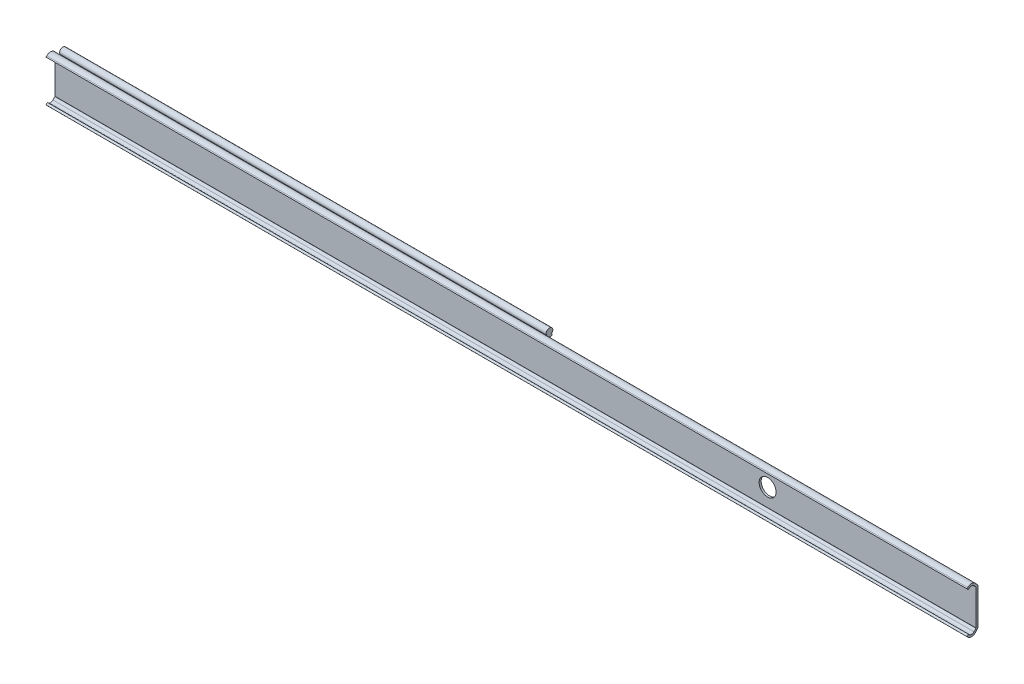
ISO-10303-21;
HEADER;
FILE_DESCRIPTION(('STEP AP214'),'2;1');
FILE_NAME('part.step','',(''),(''),'','','');
FILE_SCHEMA(('AUTOMOTIVE_DESIGN { 1 0 10303 214 1 1 1 1 }'));
ENDSEC;
DATA;
#1=APPLICATION_CONTEXT('core data for automotive mechanical design processes');
#2=APPLICATION_PROTOCOL_DEFINITION('international standard','automotive_design',2000,#1);
#3=PRODUCT_CONTEXT('',#1,'mechanical');
#4=PRODUCT('Part','Part','',(#3));
#5=PRODUCT_RELATED_PRODUCT_CATEGORY('part','',(#4));
#6=PRODUCT_DEFINITION_FORMATION('','',#4);
#7=PRODUCT_DEFINITION_CONTEXT('part definition',#1,'design');
#8=PRODUCT_DEFINITION('design','',#6,#7);
#9=PRODUCT_DEFINITION_SHAPE('','',#8);
#10=(LENGTH_UNIT() NAMED_UNIT(*) SI_UNIT(.MILLI.,.METRE.));
#11=(NAMED_UNIT(*) PLANE_ANGLE_UNIT() SI_UNIT($,.RADIAN.));
#12=(NAMED_UNIT(*) SI_UNIT($,.STERADIAN.) SOLID_ANGLE_UNIT());
#13=UNCERTAINTY_MEASURE_WITH_UNIT(LENGTH_MEASURE(1.E-05),#10,'distance_accuracy_value','');
#14=(GEOMETRIC_REPRESENTATION_CONTEXT(3) GLOBAL_UNCERTAINTY_ASSIGNED_CONTEXT((#13)) GLOBAL_UNIT_ASSIGNED_CONTEXT((#10,
#11,#12)) REPRESENTATION_CONTEXT('',''));
#15=CARTESIAN_POINT('',(0.,0.,0.));
#16=DIRECTION('',(0.,0.,1.));
#17=DIRECTION('',(1.,0.,0.));
#18=AXIS2_PLACEMENT_3D('',#15,#16,#17);
#19=CARTESIAN_POINT('',(0.,-13.561018,0.));
#20=DIRECTION('',(0.,0.,-1.));
#21=DIRECTION('',(1.,0.,0.));
#22=AXIS2_PLACEMENT_3D('',#19,#20,#21);
#23=PLANE('',#22);
#24=CARTESIAN_POINT('',(547.2,0.,0.));
#25=DIRECTION('',(0.,0.,1.));
#26=DIRECTION('',(0.,-1.,0.));
#27=AXIS2_PLACEMENT_3D('',#24,#25,#26);
#28=CIRCLE('',#27,6.5);
#29=CARTESIAN_POINT('',(547.2,-6.5,0.));
#30=VERTEX_POINT('',#29);
#31=EDGE_CURVE('E18',#30,#30,#28,.F.);
#32=ORIENTED_EDGE('',*,*,#31,.F.);
#33=EDGE_LOOP('',(#32));
#34=FACE_BOUND('',#33,.T.);
#35=DIRECTION('',(0.,1.,0.));
#36=VECTOR('',#35,1.);
#37=CARTESIAN_POINT('',(0.,-13.561018,0.));
#38=LINE('',#37,#36);
#39=CARTESIAN_POINT('',(0.,-13.561018,0.));
#40=VERTEX_POINT('',#39);
#41=CARTESIAN_POINT('',(0.,-10.7622239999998,0.));
#42=VERTEX_POINT('',#41);
#43=EDGE_CURVE('E441',#40,#42,#38,.T.);
#44=ORIENTED_EDGE('',*,*,#43,.T.);
#45=DIRECTION('',(1.,0.,0.));
#46=VECTOR('',#45,1.);
#47=CARTESIAN_POINT('',(-2.28861729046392,-10.7622239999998,0.));
#48=LINE('',#47,#46);
#49=CARTESIAN_POINT('',(373.6,-10.7622239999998,0.));
#50=VERTEX_POINT('',#49);
#51=EDGE_CURVE('E9',#42,#50,#48,.T.);
#52=ORIENTED_EDGE('',*,*,#51,.T.);
#53=DIRECTION('',(0.,-1.,0.));
#54=VECTOR('',#53,1.);
#55=CARTESIAN_POINT('',(373.6,25.,0.));
#56=LINE('',#55,#54);
#57=CARTESIAN_POINT('',(373.6,10.7622239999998,0.));
#58=VERTEX_POINT('',#57);
#59=EDGE_CURVE('E298',#58,#50,#56,.T.);
#60=ORIENTED_EDGE('',*,*,#59,.F.);
#61=DIRECTION('',(1.,0.,0.));
#62=VECTOR('',#61,1.);
#63=CARTESIAN_POINT('',(-2.28861729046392,10.7622239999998,0.));
#64=LINE('',#63,#62);
#65=CARTESIAN_POINT('',(0.,10.7622239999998,0.));
#66=VERTEX_POINT('',#65);
#67=EDGE_CURVE('E23',#66,#58,#64,.T.);
#68=ORIENTED_EDGE('',*,*,#67,.F.);
#69=CARTESIAN_POINT('',(0.,13.561018,0.));
#70=VERTEX_POINT('',#69);
#71=EDGE_CURVE('E256',#66,#70,#38,.T.);
#72=ORIENTED_EDGE('',*,*,#71,.T.);
#73=DIRECTION('',(1.,0.,0.));
#74=VECTOR('',#73,1.);
#75=CARTESIAN_POINT('',(0.,13.561018,0.));
#76=LINE('',#75,#74);
#77=CARTESIAN_POINT('',(707.2,13.561018,0.));
#78=VERTEX_POINT('',#77);
#79=EDGE_CURVE('E453',#70,#78,#76,.T.);
#80=ORIENTED_EDGE('',*,*,#79,.T.);
#81=DIRECTION('',(0.,1.,0.));
#82=VECTOR('',#81,1.);
#83=CARTESIAN_POINT('',(707.2,-13.561018,0.));
#84=LINE('',#83,#82);
#85=CARTESIAN_POINT('',(707.2,-13.561018,0.));
#86=VERTEX_POINT('',#85);
#87=EDGE_CURVE('E382',#86,#78,#84,.T.);
#88=ORIENTED_EDGE('',*,*,#87,.F.);
#89=DIRECTION('',(1.,0.,0.));
#90=VECTOR('',#89,1.);
#91=CARTESIAN_POINT('',(0.,-13.561018,0.));
#92=LINE('',#91,#90);
#93=EDGE_CURVE('E455',#40,#86,#92,.T.);
#94=ORIENTED_EDGE('',*,*,#93,.F.);
#95=EDGE_LOOP('',(#44,#52,#60,#68,#72,#80,#88,#94));
#96=FACE_BOUND('',#95,.T.);
#97=ADVANCED_FACE('F14',(#34,#96),#23,.T.);
#98=CARTESIAN_POINT('',(-2.28861729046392,11.8784795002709,-5.98462837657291));
#99=DIRECTION('',(0.,0.60181512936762,-0.798635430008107));
#100=DIRECTION('',(0.,0.798635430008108,0.60181512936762));
#101=AXIS2_PLACEMENT_3D('',#98,#99,#100);
#102=PLANE('',#101);
#103=DIRECTION('',(1.,0.,0.));
#104=VECTOR('',#103,1.);
#105=CARTESIAN_POINT('',(0.,11.6159967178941,-6.18242339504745));
#106=LINE('',#105,#104);
#107=CARTESIAN_POINT('',(0.,11.6159967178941,-6.18242339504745));
#108=VERTEX_POINT('',#107);
#109=CARTESIAN_POINT('',(373.6,11.6159967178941,-6.18242339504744));
#110=VERTEX_POINT('',#109);
#111=EDGE_CURVE('E260',#108,#110,#106,.T.);
#112=ORIENTED_EDGE('',*,*,#111,.T.);
#113=DIRECTION('',(0.,0.798635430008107,0.60181512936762));
#114=VECTOR('',#113,1.);
#115=CARTESIAN_POINT('',(373.6,11.8784795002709,-5.98462837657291));
#116=LINE('',#115,#114);
#117=CARTESIAN_POINT('',(373.6,11.0618539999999,-6.6));
#118=VERTEX_POINT('',#117);
#119=EDGE_CURVE('E322',#118,#110,#116,.T.);
#120=ORIENTED_EDGE('',*,*,#119,.F.);
#121=DIRECTION('',(1.,0.,0.));
#122=VECTOR('',#121,1.);
#123=CARTESIAN_POINT('',(-2.28861729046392,11.0618539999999,-6.6));
#124=LINE('',#123,#122);
#125=CARTESIAN_POINT('',(0.,11.0618539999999,-6.6));
#126=VERTEX_POINT('',#125);
#127=EDGE_CURVE('E334',#126,#118,#124,.T.);
#128=ORIENTED_EDGE('',*,*,#127,.F.);
#129=DIRECTION('',(0.,0.798635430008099,0.601815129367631));
#130=VECTOR('',#129,1.);
#131=CARTESIAN_POINT('',(0.,11.0618539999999,-6.6));
#132=LINE('',#131,#130);
#133=EDGE_CURVE('E247',#126,#108,#132,.T.);
#134=ORIENTED_EDGE('',*,*,#133,.T.);
#135=EDGE_LOOP('',(#112,#120,#128,#134));
#136=FACE_BOUND('',#135,.T.);
#137=ADVANCED_FACE('F544',(#136),#102,.T.);
#138=CARTESIAN_POINT('',(-2.28861729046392,11.0618539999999,-6.6));
#139=DIRECTION('',(0.,0.,-1.));
#140=DIRECTION('',(1.,0.,0.));
#141=AXIS2_PLACEMENT_3D('',#138,#139,#140);
#142=PLANE('',#141);
#143=DIRECTION('',(0.,1.,0.));
#144=VECTOR('',#143,1.);
#145=CARTESIAN_POINT('',(373.6,11.0618539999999,-6.6));
#146=LINE('',#145,#144);
#147=CARTESIAN_POINT('',(373.6,10.4239399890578,-6.6));
#148=VERTEX_POINT('',#147);
#149=EDGE_CURVE('E320',#148,#118,#146,.T.);
#150=ORIENTED_EDGE('',*,*,#149,.F.);
#151=DIRECTION('',(1.,0.,0.));
#152=VECTOR('',#151,1.);
#153=CARTESIAN_POINT('',(-2.28861729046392,10.4239399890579,-6.6));
#154=LINE('',#153,#152);
#155=CARTESIAN_POINT('',(0.,10.4239399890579,-6.6));
#156=VERTEX_POINT('',#155);
#157=EDGE_CURVE('E491',#156,#148,#154,.T.);
#158=ORIENTED_EDGE('',*,*,#157,.F.);
#159=DIRECTION('',(0.,1.,0.));
#160=VECTOR('',#159,1.);
#161=CARTESIAN_POINT('',(0.,10.4239399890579,-6.6));
#162=LINE('',#161,#160);
#163=EDGE_CURVE('E292',#156,#126,#162,.T.);
#164=ORIENTED_EDGE('',*,*,#163,.T.);
#165=ORIENTED_EDGE('',*,*,#127,.T.);
#166=EDGE_LOOP('',(#150,#158,#164,#165));
#167=FACE_BOUND('',#166,.T.);
#168=ADVANCED_FACE('F542',(#167),#142,.T.);
#169=CARTESIAN_POINT('',(-2.28861729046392,13.915,-4.44999999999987));
#170=DIRECTION('',(1.,0.,0.));
#171=DIRECTION('',(0.,0.,1.));
#172=AXIS2_PLACEMENT_3D('',#169,#170,#171);
#173=CYLINDRICAL_SURFACE('',#172,4.1);
#174=CARTESIAN_POINT('',(373.6,13.915,-4.44999999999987));
#175=DIRECTION('',(-1.,0.,0.));
#176=DIRECTION('',(0.,0.,-1.));
#177=AXIS2_PLACEMENT_3D('',#174,#175,#176);
#178=CIRCLE('',#177,4.1);
#179=CARTESIAN_POINT('',(373.6,10.8444026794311,-1.73312089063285));
#180=VERTEX_POINT('',#179);
#181=EDGE_CURVE('E318',#180,#148,#178,.F.);
#182=ORIENTED_EDGE('',*,*,#181,.F.);
#183=DIRECTION('',(1.,0.,0.));
#184=VECTOR('',#183,1.);
#185=CARTESIAN_POINT('',(-2.28861729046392,10.8444026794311,-1.73312089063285));
#186=LINE('',#185,#184);
#187=CARTESIAN_POINT('',(0.,10.8444026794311,-1.73312089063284));
#188=VERTEX_POINT('',#187);
#189=EDGE_CURVE('E494',#188,#180,#186,.T.);
#190=ORIENTED_EDGE('',*,*,#189,.F.);
#191=CARTESIAN_POINT('',(0.,13.915,-4.44999999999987));
#192=DIRECTION('',(1.,0.,0.));
#193=DIRECTION('',(0.,0.,1.));
#194=AXIS2_PLACEMENT_3D('',#191,#192,#193);
#195=CIRCLE('',#194,4.1);
#196=EDGE_CURVE('E289',#188,#156,#195,.T.);
#197=ORIENTED_EDGE('',*,*,#196,.T.);
#198=ORIENTED_EDGE('',*,*,#157,.T.);
#199=EDGE_LOOP('',(#182,#190,#197,#198));
#200=FACE_BOUND('',#199,.T.);
#201=ADVANCED_FACE('F540',(#200),#173,.T.);
#202=CARTESIAN_POINT('',(-2.28861729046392,10.7622239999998,-1.66000000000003));
#203=DIRECTION('',(1.,0.,0.));
#204=DIRECTION('',(0.,0.,1.));
#205=AXIS2_PLACEMENT_3D('',#202,#203,#204);
#206=CYLINDRICAL_SURFACE('',#205,0.110000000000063);
#207=CARTESIAN_POINT('',(373.6,10.7622239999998,-1.66000000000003));
#208=DIRECTION('',(-1.,0.,0.));
#209=DIRECTION('',(0.,0.,-1.));
#210=AXIS2_PLACEMENT_3D('',#207,#208,#209);
#211=CIRCLE('',#210,0.110000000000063);
#212=CARTESIAN_POINT('',(373.6,10.7622239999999,-1.54999999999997));
#213=VERTEX_POINT('',#212);
#214=EDGE_CURVE('E316',#213,#180,#211,.T.);
#215=ORIENTED_EDGE('',*,*,#214,.F.);
#216=DIRECTION('',(1.,0.,0.));
#217=VECTOR('',#216,1.);
#218=CARTESIAN_POINT('',(-2.28861729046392,10.7622239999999,-1.54999999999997));
#219=LINE('',#218,#217);
#220=CARTESIAN_POINT('',(0.,10.7622239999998,-1.54999999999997));
#221=VERTEX_POINT('',#220);
#222=EDGE_CURVE('E497',#221,#213,#219,.T.);
#223=ORIENTED_EDGE('',*,*,#222,.F.);
#224=CARTESIAN_POINT('',(0.,10.7622239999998,-1.66000000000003));
#225=DIRECTION('',(-1.,0.,0.));
#226=DIRECTION('',(0.,0.,1.));
#227=AXIS2_PLACEMENT_3D('',#224,#225,#226);
#228=CIRCLE('',#227,0.110000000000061);
#229=EDGE_CURVE('E286',#221,#188,#228,.T.);
#230=ORIENTED_EDGE('',*,*,#229,.T.);
#231=ORIENTED_EDGE('',*,*,#189,.T.);
#232=EDGE_LOOP('',(#215,#223,#230,#231));
#233=FACE_BOUND('',#232,.T.);
#234=ADVANCED_FACE('F536',(#233),#206,.F.);
#235=CARTESIAN_POINT('',(-2.28861729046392,-10.7622239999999,-1.54999999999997));
#236=DIRECTION('',(0.,0.,-1.));
#237=DIRECTION('',(1.,0.,0.));
#238=AXIS2_PLACEMENT_3D('',#235,#236,#237);
#239=PLANE('',#238);
#240=DIRECTION('',(0.,1.,0.));
#241=VECTOR('',#240,1.);
#242=CARTESIAN_POINT('',(373.6,-10.7622239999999,-1.54999999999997));
#243=LINE('',#242,#241);
#244=CARTESIAN_POINT('',(373.6,-10.7622239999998,-1.54999999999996));
#245=VERTEX_POINT('',#244);
#246=EDGE_CURVE('E314',#245,#213,#243,.T.);
#247=ORIENTED_EDGE('',*,*,#246,.F.);
#248=DIRECTION('',(1.,0.,0.));
#249=VECTOR('',#248,1.);
#250=CARTESIAN_POINT('',(-2.28861729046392,-10.7622239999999,-1.54999999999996));
#251=LINE('',#250,#249);
#252=CARTESIAN_POINT('',(0.,-10.7622239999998,-1.55));
#253=VERTEX_POINT('',#252);
#254=EDGE_CURVE('E500',#253,#245,#251,.T.);
#255=ORIENTED_EDGE('',*,*,#254,.F.);
#256=DIRECTION('',(0.,1.,0.));
#257=VECTOR('',#256,1.);
#258=CARTESIAN_POINT('',(0.,-10.7622239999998,-1.55));
#259=LINE('',#258,#257);
#260=EDGE_CURVE('E283',#253,#221,#259,.T.);
#261=ORIENTED_EDGE('',*,*,#260,.T.);
#262=ORIENTED_EDGE('',*,*,#222,.T.);
#263=EDGE_LOOP('',(#247,#255,#261,#262));
#264=FACE_BOUND('',#263,.T.);
#265=ADVANCED_FACE('F530',(#264),#239,.T.);
#266=CARTESIAN_POINT('',(-2.28861729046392,10.7622239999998,-1.66000000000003));
#267=DIRECTION('',(1.,0.,0.));
#268=DIRECTION('',(0.,0.,1.));
#269=AXIS2_PLACEMENT_3D('',#266,#267,#268);
#270=CYLINDRICAL_SURFACE('',#269,1.66);
#271=CARTESIAN_POINT('',(373.6,10.7622239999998,-1.66000000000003));
#272=DIRECTION('',(-1.,0.,0.));
#273=DIRECTION('',(0.,0.,-1.));
#274=AXIS2_PLACEMENT_3D('',#271,#272,#273);
#275=CIRCLE('',#274,1.66);
#276=CARTESIAN_POINT('',(373.6,12.2669175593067,-2.36106867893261));
#277=VERTEX_POINT('',#276);
#278=EDGE_CURVE('E241',#277,#58,#275,.F.);
#279=ORIENTED_EDGE('',*,*,#278,.F.);
#280=DIRECTION('',(1.,0.,0.));
#281=VECTOR('',#280,1.);
#282=CARTESIAN_POINT('',(0.,12.2669175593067,-2.3610686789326));
#283=LINE('',#282,#281);
#284=CARTESIAN_POINT('',(0.,12.2669175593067,-2.3610686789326));
#285=VERTEX_POINT('',#284);
#286=EDGE_CURVE('E237',#285,#277,#283,.T.);
#287=ORIENTED_EDGE('',*,*,#286,.F.);
#288=CARTESIAN_POINT('',(0.,10.7622239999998,-1.66000000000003));
#289=DIRECTION('',(1.,0.,0.));
#290=DIRECTION('',(0.,0.,1.));
#291=AXIS2_PLACEMENT_3D('',#288,#289,#290);
#292=CIRCLE('',#291,1.65999999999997);
#293=EDGE_CURVE('E240',#285,#66,#292,.T.);
#294=ORIENTED_EDGE('',*,*,#293,.T.);
#295=ORIENTED_EDGE('',*,*,#67,.T.);
#296=EDGE_LOOP('',(#279,#287,#294,#295));
#297=FACE_BOUND('',#296,.T.);
#298=ADVANCED_FACE('F239',(#297),#270,.T.);
#299=CARTESIAN_POINT('',(-2.28861729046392,-10.7622239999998,-1.66000000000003));
#300=DIRECTION('',(1.,0.,0.));
#301=DIRECTION('',(0.,0.,1.));
#302=AXIS2_PLACEMENT_3D('',#299,#300,#301);
#303=CYLINDRICAL_SURFACE('',#302,1.66);
#304=DIRECTION('',(1.,0.,0.));
#305=VECTOR('',#304,1.);
#306=CARTESIAN_POINT('',(0.,-12.2669175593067,-2.3610686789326));
#307=LINE('',#306,#305);
#308=CARTESIAN_POINT('',(0.,-12.2669175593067,-2.3610686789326));
#309=VERTEX_POINT('',#308);
#310=CARTESIAN_POINT('',(373.6,-12.2669175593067,-2.36106867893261));
#311=VERTEX_POINT('',#310);
#312=EDGE_CURVE('E246',#309,#311,#307,.T.);
#313=ORIENTED_EDGE('',*,*,#312,.T.);
#314=CARTESIAN_POINT('',(373.6,-10.7622239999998,-1.66000000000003));
#315=DIRECTION('',(-1.,0.,0.));
#316=DIRECTION('',(0.,0.,-1.));
#317=AXIS2_PLACEMENT_3D('',#314,#315,#316);
#318=CIRCLE('',#317,1.66);
#319=EDGE_CURVE('E311',#50,#311,#318,.F.);
#320=ORIENTED_EDGE('',*,*,#319,.F.);
#321=ORIENTED_EDGE('',*,*,#51,.F.);
#322=CARTESIAN_POINT('',(0.,-10.7622239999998,-1.66000000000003));
#323=DIRECTION('',(1.,0.,0.));
#324=DIRECTION('',(0.,0.,1.));
#325=AXIS2_PLACEMENT_3D('',#322,#323,#324);
#326=CIRCLE('',#325,1.66);
#327=EDGE_CURVE('E257',#42,#309,#326,.T.);
#328=ORIENTED_EDGE('',*,*,#327,.T.);
#329=EDGE_LOOP('',(#313,#320,#321,#328));
#330=FACE_BOUND('',#329,.T.);
#331=ADVANCED_FACE('F550',(#330),#303,.T.);
#332=CARTESIAN_POINT('',(-2.28861729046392,-10.7622239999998,-1.66000000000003));
#333=DIRECTION('',(1.,0.,0.));
#334=DIRECTION('',(0.,0.,1.));
#335=AXIS2_PLACEMENT_3D('',#332,#333,#334);
#336=CYLINDRICAL_SURFACE('',#335,0.110000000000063);
#337=CARTESIAN_POINT('',(373.6,-10.7622239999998,-1.66000000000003));
#338=DIRECTION('',(-1.,0.,0.));
#339=DIRECTION('',(0.,0.,-1.));
#340=AXIS2_PLACEMENT_3D('',#337,#338,#339);
#341=CIRCLE('',#340,0.110000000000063);
#342=CARTESIAN_POINT('',(373.6,-10.8444026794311,-1.73312089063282));
#343=VERTEX_POINT('',#342);
#344=EDGE_CURVE('E309',#343,#245,#341,.T.);
#345=ORIENTED_EDGE('',*,*,#344,.F.);
#346=DIRECTION('',(1.,0.,0.));
#347=VECTOR('',#346,1.);
#348=CARTESIAN_POINT('',(-2.28861729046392,-10.8444026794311,-1.73312089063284));
#349=LINE('',#348,#347);
#350=CARTESIAN_POINT('',(0.,-10.8444026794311,-1.73312089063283));
#351=VERTEX_POINT('',#350);
#352=EDGE_CURVE('E503',#351,#343,#349,.T.);
#353=ORIENTED_EDGE('',*,*,#352,.F.);
#354=CARTESIAN_POINT('',(0.,-10.7622239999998,-1.66000000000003));
#355=DIRECTION('',(-1.,0.,0.));
#356=DIRECTION('',(0.,0.,1.));
#357=AXIS2_PLACEMENT_3D('',#354,#355,#356);
#358=CIRCLE('',#357,0.110000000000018);
#359=EDGE_CURVE('E280',#351,#253,#358,.T.);
#360=ORIENTED_EDGE('',*,*,#359,.T.);
#361=ORIENTED_EDGE('',*,*,#254,.T.);
#362=EDGE_LOOP('',(#345,#353,#360,#361));
#363=FACE_BOUND('',#362,.T.);
#364=ADVANCED_FACE('F528',(#363),#336,.F.);
#365=CARTESIAN_POINT('',(-2.28861729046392,-13.915,-4.44999999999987));
#366=DIRECTION('',(1.,0.,0.));
#367=DIRECTION('',(0.,0.,1.));
#368=AXIS2_PLACEMENT_3D('',#365,#366,#367);
#369=CYLINDRICAL_SURFACE('',#368,4.1);
#370=CARTESIAN_POINT('',(373.6,-13.915,-4.44999999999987));
#371=DIRECTION('',(-1.,0.,0.));
#372=DIRECTION('',(0.,0.,-1.));
#373=AXIS2_PLACEMENT_3D('',#370,#371,#372);
#374=CIRCLE('',#373,4.1);
#375=CARTESIAN_POINT('',(373.6,-10.4239399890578,-6.6));
#376=VERTEX_POINT('',#375);
#377=EDGE_CURVE('E307',#376,#343,#374,.F.);
#378=ORIENTED_EDGE('',*,*,#377,.F.);
#379=DIRECTION('',(1.,0.,0.));
#380=VECTOR('',#379,1.);
#381=CARTESIAN_POINT('',(-2.28861729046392,-10.4239399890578,-6.6));
#382=LINE('',#381,#380);
#383=CARTESIAN_POINT('',(0.,-10.4239399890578,-6.6));
#384=VERTEX_POINT('',#383);
#385=EDGE_CURVE('E506',#384,#376,#382,.T.);
#386=ORIENTED_EDGE('',*,*,#385,.F.);
#387=CARTESIAN_POINT('',(0.,-13.915,-4.44999999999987));
#388=DIRECTION('',(1.,0.,0.));
#389=DIRECTION('',(0.,0.,1.));
#390=AXIS2_PLACEMENT_3D('',#387,#388,#389);
#391=CIRCLE('',#390,4.1);
#392=EDGE_CURVE('E277',#384,#351,#391,.T.);
#393=ORIENTED_EDGE('',*,*,#392,.T.);
#394=ORIENTED_EDGE('',*,*,#352,.T.);
#395=EDGE_LOOP('',(#378,#386,#393,#394));
#396=FACE_BOUND('',#395,.T.);
#397=ADVANCED_FACE('F522',(#396),#369,.T.);
#398=CARTESIAN_POINT('',(-2.28861729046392,-11.0618539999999,-6.6));
#399=DIRECTION('',(0.,0.,-1.));
#400=DIRECTION('',(1.,0.,0.));
#401=AXIS2_PLACEMENT_3D('',#398,#399,#400);
#402=PLANE('',#401);
#403=DIRECTION('',(0.,1.,0.));
#404=VECTOR('',#403,1.);
#405=CARTESIAN_POINT('',(373.6,-11.0618539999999,-6.6));
#406=LINE('',#405,#404);
#407=CARTESIAN_POINT('',(373.6,-11.0618539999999,-6.6));
#408=VERTEX_POINT('',#407);
#409=EDGE_CURVE('E305',#408,#376,#406,.T.);
#410=ORIENTED_EDGE('',*,*,#409,.F.);
#411=DIRECTION('',(1.,0.,0.));
#412=VECTOR('',#411,1.);
#413=CARTESIAN_POINT('',(-2.28861729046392,-11.0618539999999,-6.6));
#414=LINE('',#413,#412);
#415=CARTESIAN_POINT('',(0.,-11.0618539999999,-6.6));
#416=VERTEX_POINT('',#415);
#417=EDGE_CURVE('E329',#416,#408,#414,.T.);
#418=ORIENTED_EDGE('',*,*,#417,.F.);
#419=DIRECTION('',(0.,1.,0.));
#420=VECTOR('',#419,1.);
#421=CARTESIAN_POINT('',(0.,-11.0618539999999,-6.6));
#422=LINE('',#421,#420);
#423=EDGE_CURVE('E274',#416,#384,#422,.T.);
#424=ORIENTED_EDGE('',*,*,#423,.T.);
#425=ORIENTED_EDGE('',*,*,#385,.T.);
#426=EDGE_LOOP('',(#410,#418,#424,#425));
#427=FACE_BOUND('',#426,.T.);
#428=ADVANCED_FACE('F515',(#427),#402,.T.);
#429=CARTESIAN_POINT('',(-2.28861729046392,-11.8784795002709,-5.98462837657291));
#430=DIRECTION('',(0.,-0.60181512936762,-0.798635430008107));
#431=DIRECTION('',(0.,0.798635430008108,-0.60181512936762));
#432=AXIS2_PLACEMENT_3D('',#429,#430,#431);
#433=PLANE('',#432);
#434=DIRECTION('',(0.,0.798635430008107,-0.60181512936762));
#435=VECTOR('',#434,1.);
#436=CARTESIAN_POINT('',(373.6,-11.8784795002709,-5.98462837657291));
#437=LINE('',#436,#435);
#438=CARTESIAN_POINT('',(373.6,-11.6159967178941,-6.18242339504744));
#439=VERTEX_POINT('',#438);
#440=EDGE_CURVE('E303',#439,#408,#437,.T.);
#441=ORIENTED_EDGE('',*,*,#440,.F.);
#442=DIRECTION('',(1.,0.,0.));
#443=VECTOR('',#442,1.);
#444=CARTESIAN_POINT('',(0.,-11.6159967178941,-6.18242339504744));
#445=LINE('',#444,#443);
#446=CARTESIAN_POINT('',(0.,-11.6159967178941,-6.18242339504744));
#447=VERTEX_POINT('',#446);
#448=EDGE_CURVE('E299',#447,#439,#445,.T.);
#449=ORIENTED_EDGE('',*,*,#448,.F.);
#450=DIRECTION('',(0.,0.798635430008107,-0.601815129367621));
#451=VECTOR('',#450,1.);
#452=CARTESIAN_POINT('',(0.,-11.6159967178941,-6.18242339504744));
#453=LINE('',#452,#451);
#454=EDGE_CURVE('E271',#447,#416,#453,.T.);
#455=ORIENTED_EDGE('',*,*,#454,.T.);
#456=ORIENTED_EDGE('',*,*,#417,.T.);
#457=EDGE_LOOP('',(#441,#449,#455,#456));
#458=FACE_BOUND('',#457,.T.);
#459=ADVANCED_FACE('F16',(#458),#433,.T.);
#460=CARTESIAN_POINT('',(707.2,13.5750000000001,5.00000000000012));
#461=DIRECTION('',(-1.,0.,0.));
#462=DIRECTION('',(0.,0.,-1.));
#463=AXIS2_PLACEMENT_3D('',#460,#461,#462);
#464=PLANE('',#463);
#465=CARTESIAN_POINT('',(707.2,13.5750000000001,5.00000000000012));
#466=DIRECTION('',(1.,0.,0.));
#467=DIRECTION('',(0.,0.,-1.));
#468=AXIS2_PLACEMENT_3D('',#465,#466,#467);
#469=CIRCLE('',#468,4.1);
#470=CARTESIAN_POINT('',(707.2,16.4741282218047,2.10085261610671));
#471=VERTEX_POINT('',#470);
#472=CARTESIAN_POINT('',(707.2,16.4741282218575,7.89914738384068));
#473=VERTEX_POINT('',#472);
#474=EDGE_CURVE('E330',#471,#473,#469,.T.);
#475=ORIENTED_EDGE('',*,*,#474,.T.);
#476=DIRECTION('',(0.,-0.721504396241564,0.692409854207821));
#477=VECTOR('',#476,1.);
#478=CARTESIAN_POINT('',(707.2,15.8897090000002,8.45999999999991));
#479=LINE('',#478,#477);
#480=CARTESIAN_POINT('',(707.2,15.8897090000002,8.45999999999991));
#481=VERTEX_POINT('',#480);
#482=EDGE_CURVE('E333',#473,#481,#479,.T.);
#483=ORIENTED_EDGE('',*,*,#482,.T.);
#484=DIRECTION('',(0.,-0.707106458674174,-0.707107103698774));
#485=VECTOR('',#484,1.);
#486=CARTESIAN_POINT('',(707.2,14.7934620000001,7.363752));
#487=LINE('',#486,#485);
#488=CARTESIAN_POINT('',(707.2,14.7934620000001,7.363752));
#489=VERTEX_POINT('',#488);
#490=EDGE_CURVE('E337',#481,#489,#487,.T.);
#491=ORIENTED_EDGE('',*,*,#490,.T.);
#492=DIRECTION('',(0.,0.721503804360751,-0.692410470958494));
#493=VECTOR('',#492,1.);
#494=CARTESIAN_POINT('',(707.2,15.3880487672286,6.79314086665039));
#495=LINE('',#494,#493);
#496=CARTESIAN_POINT('',(707.2,15.3880487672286,6.79314086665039));
#497=VERTEX_POINT('',#496);
#498=EDGE_CURVE('E340',#489,#497,#495,.T.);
#499=ORIENTED_EDGE('',*,*,#498,.T.);
#500=CARTESIAN_POINT('',(707.2,13.5750000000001,5.00000000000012));
#501=DIRECTION('',(-1.,0.,0.));
#502=DIRECTION('',(0.,0.,1.));
#503=AXIS2_PLACEMENT_3D('',#500,#501,#502);
#504=CIRCLE('',#503,2.55);
#505=CARTESIAN_POINT('',(707.2,15.2920682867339,3.11474762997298));
#506=VERTEX_POINT('',#505);
#507=EDGE_CURVE('E343',#497,#506,#504,.T.);
#508=ORIENTED_EDGE('',*,*,#507,.T.);
#509=DIRECTION('',(0.,-0.721504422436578,-0.692409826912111));
#510=VECTOR('',#509,1.);
#511=CARTESIAN_POINT('',(707.2,13.7341205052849,1.61962394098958));
#512=LINE('',#511,#510);
#513=CARTESIAN_POINT('',(707.2,13.7341205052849,1.61962394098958));
#514=VERTEX_POINT('',#513);
#515=EDGE_CURVE('E346',#506,#514,#512,.T.);
#516=ORIENTED_EDGE('',*,*,#515,.T.);
#517=CARTESIAN_POINT('',(707.2,13.561018,1.80000000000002));
#518=DIRECTION('',(-1.,0.,0.));
#519=DIRECTION('',(0.,0.,1.));
#520=AXIS2_PLACEMENT_3D('',#517,#518,#519);
#521=CIRCLE('',#520,0.250000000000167);
#522=CARTESIAN_POINT('',(707.2,13.561018,1.54999999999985));
#523=VERTEX_POINT('',#522);
#524=EDGE_CURVE('E349',#514,#523,#521,.T.);
#525=ORIENTED_EDGE('',*,*,#524,.T.);
#526=DIRECTION('',(0.,-1.,0.));
#527=VECTOR('',#526,1.);
#528=CARTESIAN_POINT('',(707.2,13.561018,1.54999999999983));
#529=LINE('',#528,#527);
#530=CARTESIAN_POINT('',(707.2,-13.561018,1.54999999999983));
#531=VERTEX_POINT('',#530);
#532=EDGE_CURVE('E352',#523,#531,#529,.T.);
#533=ORIENTED_EDGE('',*,*,#532,.T.);
#534=CARTESIAN_POINT('',(707.2,-13.561018,1.80000000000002));
#535=DIRECTION('',(-1.,0.,0.));
#536=DIRECTION('',(0.,0.,-1.));
#537=AXIS2_PLACEMENT_3D('',#534,#535,#536);
#538=CIRCLE('',#537,0.250000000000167);
#539=CARTESIAN_POINT('',(707.2,-13.734120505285,1.61962394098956));
#540=VERTEX_POINT('',#539);
#541=EDGE_CURVE('E355',#531,#540,#538,.T.);
#542=ORIENTED_EDGE('',*,*,#541,.T.);
#543=DIRECTION('',(0.,-0.721504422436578,0.692409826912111));
#544=VECTOR('',#543,1.);
#545=CARTESIAN_POINT('',(707.2,-13.7341205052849,1.61962394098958));
#546=LINE('',#545,#544);
#547=CARTESIAN_POINT('',(707.2,-15.2920682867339,3.11474762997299));
#548=VERTEX_POINT('',#547);
#549=EDGE_CURVE('E358',#540,#548,#546,.T.);
#550=ORIENTED_EDGE('',*,*,#549,.T.);
#551=CARTESIAN_POINT('',(707.2,-13.5750000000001,5.00000000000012));
#552=DIRECTION('',(-1.,0.,0.));
#553=DIRECTION('',(0.,0.,-1.));
#554=AXIS2_PLACEMENT_3D('',#551,#552,#553);
#555=CIRCLE('',#554,2.55);
#556=CARTESIAN_POINT('',(707.2,-15.3880487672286,6.79314086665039));
#557=VERTEX_POINT('',#556);
#558=EDGE_CURVE('E361',#548,#557,#555,.T.);
#559=ORIENTED_EDGE('',*,*,#558,.T.);
#560=DIRECTION('',(0.,0.721503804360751,0.692410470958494));
#561=VECTOR('',#560,1.);
#562=CARTESIAN_POINT('',(707.2,-15.3880487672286,6.79314086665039));
#563=LINE('',#562,#561);
#564=CARTESIAN_POINT('',(707.2,-14.7934620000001,7.363752));
#565=VERTEX_POINT('',#564);
#566=EDGE_CURVE('E364',#557,#565,#563,.T.);
#567=ORIENTED_EDGE('',*,*,#566,.T.);
#568=DIRECTION('',(0.,-0.707106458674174,0.707107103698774));
#569=VECTOR('',#568,1.);
#570=CARTESIAN_POINT('',(707.2,-14.7934620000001,7.363752));
#571=LINE('',#570,#569);
#572=CARTESIAN_POINT('',(707.2,-15.8897090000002,8.45999999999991));
#573=VERTEX_POINT('',#572);
#574=EDGE_CURVE('E367',#565,#573,#571,.T.);
#575=ORIENTED_EDGE('',*,*,#574,.T.);
#576=DIRECTION('',(0.,-0.721504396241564,-0.692409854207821));
#577=VECTOR('',#576,1.);
#578=CARTESIAN_POINT('',(707.2,-15.8897090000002,8.45999999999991));
#579=LINE('',#578,#577);
#580=CARTESIAN_POINT('',(707.2,-16.4741282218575,7.89914738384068));
#581=VERTEX_POINT('',#580);
#582=EDGE_CURVE('E370',#573,#581,#579,.T.);
#583=ORIENTED_EDGE('',*,*,#582,.T.);
#584=CARTESIAN_POINT('',(707.2,-13.5750000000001,5.00000000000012));
#585=DIRECTION('',(1.,0.,0.));
#586=DIRECTION('',(0.,0.,1.));
#587=AXIS2_PLACEMENT_3D('',#584,#585,#586);
#588=CIRCLE('',#587,4.1);
#589=CARTESIAN_POINT('',(707.2,-16.4741282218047,2.10085261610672));
#590=VERTEX_POINT('',#589);
#591=EDGE_CURVE('E373',#581,#590,#588,.T.);
#592=ORIENTED_EDGE('',*,*,#591,.T.);
#593=DIRECTION('',(0.,0.721504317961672,-0.692409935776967));
#594=VECTOR('',#593,1.);
#595=CARTESIAN_POINT('',(707.2,-14.8073560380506,0.501292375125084));
#596=LINE('',#595,#594);
#597=CARTESIAN_POINT('',(707.2,-14.8073560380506,0.501292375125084));
#598=VERTEX_POINT('',#597);
#599=EDGE_CURVE('E376',#590,#598,#596,.T.);
#600=ORIENTED_EDGE('',*,*,#599,.T.);
#601=CARTESIAN_POINT('',(707.2,-13.561018,1.80000000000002));
#602=DIRECTION('',(1.,0.,0.));
#603=DIRECTION('',(0.,0.,1.));
#604=AXIS2_PLACEMENT_3D('',#601,#602,#603);
#605=CIRCLE('',#604,1.8);
#606=EDGE_CURVE('E379',#598,#86,#605,.T.);
#607=ORIENTED_EDGE('',*,*,#606,.T.);
#608=ORIENTED_EDGE('',*,*,#87,.T.);
#609=CARTESIAN_POINT('',(707.2,13.561018,1.80000000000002));
#610=DIRECTION('',(1.,0.,0.));
#611=DIRECTION('',(0.,0.,-1.));
#612=AXIS2_PLACEMENT_3D('',#609,#610,#611);
#613=CIRCLE('',#612,1.8);
#614=CARTESIAN_POINT('',(707.2,14.8073560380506,0.501292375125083));
#615=VERTEX_POINT('',#614);
#616=EDGE_CURVE('E385',#78,#615,#613,.T.);
#617=ORIENTED_EDGE('',*,*,#616,.T.);
#618=DIRECTION('',(0.,0.721504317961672,0.692409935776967));
#619=VECTOR('',#618,1.);
#620=CARTESIAN_POINT('',(707.2,14.8073560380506,0.501292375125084));
#621=LINE('',#620,#619);
#622=EDGE_CURVE('E388',#615,#471,#621,.T.);
#623=ORIENTED_EDGE('',*,*,#622,.T.);
#624=EDGE_LOOP('',(#475,#483,#491,#499,#508,#516,#525,#533,#542,#550,#559,#567,#575,#583,#592,
#600,#607,#608,#617,#623));
#625=FACE_BOUND('',#624,.T.);
#626=ADVANCED_FACE('F638',(#625),#464,.F.);
#627=CARTESIAN_POINT('',(0.,15.8897090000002,8.45999999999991));
#628=DIRECTION('',(0.,0.692409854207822,0.721504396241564));
#629=DIRECTION('',(0.,-0.721504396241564,0.692409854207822));
#630=AXIS2_PLACEMENT_3D('',#627,#628,#629);
#631=PLANE('',#630);
#632=ORIENTED_EDGE('',*,*,#482,.F.);
#633=DIRECTION('',(1.,0.,0.));
#634=VECTOR('',#633,1.);
#635=CARTESIAN_POINT('',(0.,16.4741282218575,7.89914738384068));
#636=LINE('',#635,#634);
#637=CARTESIAN_POINT('',(0.,16.4741282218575,7.89914738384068));
#638=VERTEX_POINT('',#637);
#639=EDGE_CURVE('E448',#638,#473,#636,.T.);
#640=ORIENTED_EDGE('',*,*,#639,.F.);
#641=DIRECTION('',(0.,-0.721504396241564,0.692409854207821));
#642=VECTOR('',#641,1.);
#643=CARTESIAN_POINT('',(0.,15.8897090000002,8.45999999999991));
#644=LINE('',#643,#642);
#645=CARTESIAN_POINT('',(0.,15.8897090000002,8.45999999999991));
#646=VERTEX_POINT('',#645);
#647=EDGE_CURVE('E394',#638,#646,#644,.T.);
#648=ORIENTED_EDGE('',*,*,#647,.T.);
#649=DIRECTION('',(1.,0.,0.));
#650=VECTOR('',#649,1.);
#651=CARTESIAN_POINT('',(0.,15.8897090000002,8.45999999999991));
#652=LINE('',#651,#650);
#653=EDGE_CURVE('E485',#646,#481,#652,.T.);
#654=ORIENTED_EDGE('',*,*,#653,.T.);
#655=EDGE_LOOP('',(#632,#640,#648,#654));
#656=FACE_BOUND('',#655,.T.);
#657=ADVANCED_FACE('F634',(#656),#631,.T.);
#658=CARTESIAN_POINT('',(0.,14.7934620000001,7.363752));
#659=DIRECTION('',(0.,-0.707107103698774,0.707106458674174));
#660=DIRECTION('',(0.,-0.707106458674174,-0.707107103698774));
#661=AXIS2_PLACEMENT_3D('',#658,#659,#660);
#662=PLANE('',#661);
#663=ORIENTED_EDGE('',*,*,#490,.F.);
#664=ORIENTED_EDGE('',*,*,#653,.F.);
#665=DIRECTION('',(0.,-0.707106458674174,-0.707107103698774));
#666=VECTOR('',#665,1.);
#667=CARTESIAN_POINT('',(0.,14.7934620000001,7.363752));
#668=LINE('',#667,#666);
#669=CARTESIAN_POINT('',(0.,14.7934620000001,7.363752));
#670=VERTEX_POINT('',#669);
#671=EDGE_CURVE('E397',#646,#670,#668,.T.);
#672=ORIENTED_EDGE('',*,*,#671,.T.);
#673=DIRECTION('',(1.,0.,0.));
#674=VECTOR('',#673,1.);
#675=CARTESIAN_POINT('',(0.,14.7934620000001,7.363752));
#676=LINE('',#675,#674);
#677=EDGE_CURVE('E483',#670,#489,#676,.T.);
#678=ORIENTED_EDGE('',*,*,#677,.T.);
#679=EDGE_LOOP('',(#663,#664,#672,#678));
#680=FACE_BOUND('',#679,.T.);
#681=ADVANCED_FACE('F630',(#680),#662,.T.);
#682=CARTESIAN_POINT('',(0.,15.3880487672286,6.79314086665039));
#683=DIRECTION('',(0.,-0.692410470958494,-0.721503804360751));
#684=DIRECTION('',(0.,0.721503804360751,-0.692410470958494));
#685=AXIS2_PLACEMENT_3D('',#682,#683,#684);
#686=PLANE('',#685);
#687=ORIENTED_EDGE('',*,*,#498,.F.);
#688=ORIENTED_EDGE('',*,*,#677,.F.);
#689=DIRECTION('',(0.,0.721503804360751,-0.692410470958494));
#690=VECTOR('',#689,1.);
#691=CARTESIAN_POINT('',(0.,15.3880487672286,6.79314086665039));
#692=LINE('',#691,#690);
#693=CARTESIAN_POINT('',(0.,15.3880487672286,6.79314086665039));
#694=VERTEX_POINT('',#693);
#695=EDGE_CURVE('E400',#670,#694,#692,.T.);
#696=ORIENTED_EDGE('',*,*,#695,.T.);
#697=DIRECTION('',(1.,0.,0.));
#698=VECTOR('',#697,1.);
#699=CARTESIAN_POINT('',(0.,15.3880487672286,6.79314086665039));
#700=LINE('',#699,#698);
#701=EDGE_CURVE('E481',#694,#497,#700,.T.);
#702=ORIENTED_EDGE('',*,*,#701,.T.);
#703=EDGE_LOOP('',(#687,#688,#696,#702));
#704=FACE_BOUND('',#703,.T.);
#705=ADVANCED_FACE('F626',(#704),#686,.T.);
#706=CARTESIAN_POINT('',(0.,13.5750000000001,5.00000000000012));
#707=DIRECTION('',(1.,0.,0.));
#708=DIRECTION('',(0.,0.,1.));
#709=AXIS2_PLACEMENT_3D('',#706,#707,#708);
#710=CYLINDRICAL_SURFACE('',#709,2.55);
#711=ORIENTED_EDGE('',*,*,#507,.F.);
#712=ORIENTED_EDGE('',*,*,#701,.F.);
#713=CARTESIAN_POINT('',(0.,13.5750000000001,5.00000000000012));
#714=DIRECTION('',(-1.,0.,0.));
#715=DIRECTION('',(0.,0.,1.));
#716=AXIS2_PLACEMENT_3D('',#713,#714,#715);
#717=CIRCLE('',#716,2.55);
#718=CARTESIAN_POINT('',(0.,15.2920682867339,3.11474762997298));
#719=VERTEX_POINT('',#718);
#720=EDGE_CURVE('E403',#694,#719,#717,.T.);
#721=ORIENTED_EDGE('',*,*,#720,.T.);
#722=DIRECTION('',(1.,0.,0.));
#723=VECTOR('',#722,1.);
#724=CARTESIAN_POINT('',(0.,15.2920682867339,3.11474762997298));
#725=LINE('',#724,#723);
#726=EDGE_CURVE('E479',#719,#506,#725,.T.);
#727=ORIENTED_EDGE('',*,*,#726,.T.);
#728=EDGE_LOOP('',(#711,#712,#721,#727));
#729=FACE_BOUND('',#728,.T.);
#730=ADVANCED_FACE('F622',(#729),#710,.F.);
#731=CARTESIAN_POINT('',(0.,13.7341205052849,1.61962394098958));
#732=DIRECTION('',(0.,-0.692409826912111,0.721504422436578));
#733=DIRECTION('',(0.,-0.721504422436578,-0.692409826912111));
#734=AXIS2_PLACEMENT_3D('',#731,#732,#733);
#735=PLANE('',#734);
#736=ORIENTED_EDGE('',*,*,#515,.F.);
#737=ORIENTED_EDGE('',*,*,#726,.F.);
#738=DIRECTION('',(0.,-0.721504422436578,-0.692409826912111));
#739=VECTOR('',#738,1.);
#740=CARTESIAN_POINT('',(0.,13.7341205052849,1.61962394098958));
#741=LINE('',#740,#739);
#742=CARTESIAN_POINT('',(0.,13.7341205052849,1.61962394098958));
#743=VERTEX_POINT('',#742);
#744=EDGE_CURVE('E406',#719,#743,#741,.T.);
#745=ORIENTED_EDGE('',*,*,#744,.T.);
#746=DIRECTION('',(1.,0.,0.));
#747=VECTOR('',#746,1.);
#748=CARTESIAN_POINT('',(0.,13.7341205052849,1.61962394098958));
#749=LINE('',#748,#747);
#750=EDGE_CURVE('E477',#743,#514,#749,.T.);
#751=ORIENTED_EDGE('',*,*,#750,.T.);
#752=EDGE_LOOP('',(#736,#737,#745,#751));
#753=FACE_BOUND('',#752,.T.);
#754=ADVANCED_FACE('F618',(#753),#735,.T.);
#755=CARTESIAN_POINT('',(0.,13.561018,1.80000000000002));
#756=DIRECTION('',(1.,0.,0.));
#757=DIRECTION('',(0.,0.,1.));
#758=AXIS2_PLACEMENT_3D('',#755,#756,#757);
#759=CYLINDRICAL_SURFACE('',#758,0.250000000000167);
#760=ORIENTED_EDGE('',*,*,#524,.F.);
#761=ORIENTED_EDGE('',*,*,#750,.F.);
#762=CARTESIAN_POINT('',(0.,13.561018,1.80000000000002));
#763=DIRECTION('',(-1.,0.,0.));
#764=DIRECTION('',(0.,0.,1.));
#765=AXIS2_PLACEMENT_3D('',#762,#763,#764);
#766=CIRCLE('',#765,0.250000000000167);
#767=CARTESIAN_POINT('',(0.,13.561018,1.54999999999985));
#768=VERTEX_POINT('',#767);
#769=EDGE_CURVE('E409',#743,#768,#766,.T.);
#770=ORIENTED_EDGE('',*,*,#769,.T.);
#771=DIRECTION('',(1.,0.,0.));
#772=VECTOR('',#771,1.);
#773=CARTESIAN_POINT('',(0.,13.561018,1.54999999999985));
#774=LINE('',#773,#772);
#775=EDGE_CURVE('E475',#768,#523,#774,.T.);
#776=ORIENTED_EDGE('',*,*,#775,.T.);
#777=EDGE_LOOP('',(#760,#761,#770,#776));
#778=FACE_BOUND('',#777,.T.);
#779=ADVANCED_FACE('F614',(#778),#759,.F.);
#780=CARTESIAN_POINT('',(0.,13.561018,1.54999999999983));
#781=DIRECTION('',(0.,0.,1.));
#782=DIRECTION('',(-1.,0.,0.));
#783=AXIS2_PLACEMENT_3D('',#780,#781,#782);
#784=PLANE('',#783);
#785=CARTESIAN_POINT('',(547.2,0.,1.54999999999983));
#786=DIRECTION('',(0.,0.,1.));
#787=DIRECTION('',(-1.,0.,0.));
#788=AXIS2_PLACEMENT_3D('',#785,#786,#787);
#789=CIRCLE('',#788,6.5);
#790=CARTESIAN_POINT('',(540.7,0.,1.54999999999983));
#791=VERTEX_POINT('',#790);
#792=EDGE_CURVE('E326',#791,#791,#789,.T.);
#793=ORIENTED_EDGE('',*,*,#792,.F.);
#794=EDGE_LOOP('',(#793));
#795=FACE_BOUND('',#794,.T.);
#796=ORIENTED_EDGE('',*,*,#532,.F.);
#797=ORIENTED_EDGE('',*,*,#775,.F.);
#798=DIRECTION('',(0.,-1.,0.));
#799=VECTOR('',#798,1.);
#800=CARTESIAN_POINT('',(0.,13.561018,1.54999999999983));
#801=LINE('',#800,#799);
#802=CARTESIAN_POINT('',(0.,-13.561018,1.54999999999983));
#803=VERTEX_POINT('',#802);
#804=EDGE_CURVE('E412',#768,#803,#801,.T.);
#805=ORIENTED_EDGE('',*,*,#804,.T.);
#806=DIRECTION('',(1.,0.,0.));
#807=VECTOR('',#806,1.);
#808=CARTESIAN_POINT('',(0.,-13.561018,1.54999999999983));
#809=LINE('',#808,#807);
#810=EDGE_CURVE('E473',#803,#531,#809,.T.);
#811=ORIENTED_EDGE('',*,*,#810,.T.);
#812=EDGE_LOOP('',(#796,#797,#805,#811));
#813=FACE_BOUND('',#812,.T.);
#814=ADVANCED_FACE('F610',(#795,#813),#784,.T.);
#815=CARTESIAN_POINT('',(0.,-13.561018,1.80000000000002));
#816=DIRECTION('',(1.,0.,0.));
#817=DIRECTION('',(0.,0.,1.));
#818=AXIS2_PLACEMENT_3D('',#815,#816,#817);
#819=CYLINDRICAL_SURFACE('',#818,0.250000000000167);
#820=ORIENTED_EDGE('',*,*,#541,.F.);
#821=ORIENTED_EDGE('',*,*,#810,.F.);
#822=CARTESIAN_POINT('',(0.,-13.561018,1.80000000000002));
#823=DIRECTION('',(-1.,0.,0.));
#824=DIRECTION('',(0.,0.,-1.));
#825=AXIS2_PLACEMENT_3D('',#822,#823,#824);
#826=CIRCLE('',#825,0.250000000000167);
#827=CARTESIAN_POINT('',(0.,-13.734120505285,1.61962394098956));
#828=VERTEX_POINT('',#827);
#829=EDGE_CURVE('E415',#803,#828,#826,.T.);
#830=ORIENTED_EDGE('',*,*,#829,.T.);
#831=DIRECTION('',(1.,0.,0.));
#832=VECTOR('',#831,1.);
#833=CARTESIAN_POINT('',(0.,-13.734120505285,1.61962394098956));
#834=LINE('',#833,#832);
#835=EDGE_CURVE('E471',#828,#540,#834,.T.);
#836=ORIENTED_EDGE('',*,*,#835,.T.);
#837=EDGE_LOOP('',(#820,#821,#830,#836));
#838=FACE_BOUND('',#837,.T.);
#839=ADVANCED_FACE('F606',(#838),#819,.F.);
#840=CARTESIAN_POINT('',(0.,-13.7341205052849,1.61962394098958));
#841=DIRECTION('',(0.,0.692409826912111,0.721504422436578));
#842=DIRECTION('',(0.,-0.721504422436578,0.692409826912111));
#843=AXIS2_PLACEMENT_3D('',#840,#841,#842);
#844=PLANE('',#843);
#845=ORIENTED_EDGE('',*,*,#549,.F.);
#846=ORIENTED_EDGE('',*,*,#835,.F.);
#847=DIRECTION('',(0.,-0.721504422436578,0.692409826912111));
#848=VECTOR('',#847,1.);
#849=CARTESIAN_POINT('',(0.,-13.7341205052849,1.61962394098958));
#850=LINE('',#849,#848);
#851=CARTESIAN_POINT('',(0.,-15.2920682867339,3.11474762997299));
#852=VERTEX_POINT('',#851);
#853=EDGE_CURVE('E418',#828,#852,#850,.T.);
#854=ORIENTED_EDGE('',*,*,#853,.T.);
#855=DIRECTION('',(1.,0.,0.));
#856=VECTOR('',#855,1.);
#857=CARTESIAN_POINT('',(0.,-15.2920682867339,3.11474762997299));
#858=LINE('',#857,#856);
#859=EDGE_CURVE('E469',#852,#548,#858,.T.);
#860=ORIENTED_EDGE('',*,*,#859,.T.);
#861=EDGE_LOOP('',(#845,#846,#854,#860));
#862=FACE_BOUND('',#861,.T.);
#863=ADVANCED_FACE('F602',(#862),#844,.T.);
#864=CARTESIAN_POINT('',(0.,-13.5750000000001,5.00000000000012));
#865=DIRECTION('',(1.,0.,0.));
#866=DIRECTION('',(0.,0.,1.));
#867=AXIS2_PLACEMENT_3D('',#864,#865,#866);
#868=CYLINDRICAL_SURFACE('',#867,2.55);
#869=ORIENTED_EDGE('',*,*,#558,.F.);
#870=ORIENTED_EDGE('',*,*,#859,.F.);
#871=CARTESIAN_POINT('',(0.,-13.5750000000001,5.00000000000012));
#872=DIRECTION('',(-1.,0.,0.));
#873=DIRECTION('',(0.,0.,-1.));
#874=AXIS2_PLACEMENT_3D('',#871,#872,#873);
#875=CIRCLE('',#874,2.55);
#876=CARTESIAN_POINT('',(0.,-15.3880487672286,6.79314086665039));
#877=VERTEX_POINT('',#876);
#878=EDGE_CURVE('E421',#852,#877,#875,.T.);
#879=ORIENTED_EDGE('',*,*,#878,.T.);
#880=DIRECTION('',(1.,0.,0.));
#881=VECTOR('',#880,1.);
#882=CARTESIAN_POINT('',(0.,-15.3880487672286,6.79314086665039));
#883=LINE('',#882,#881);
#884=EDGE_CURVE('E467',#877,#557,#883,.T.);
#885=ORIENTED_EDGE('',*,*,#884,.T.);
#886=EDGE_LOOP('',(#869,#870,#879,#885));
#887=FACE_BOUND('',#886,.T.);
#888=ADVANCED_FACE('F598',(#887),#868,.F.);
#889=CARTESIAN_POINT('',(0.,-15.3880487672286,6.79314086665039));
#890=DIRECTION('',(0.,0.692410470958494,-0.721503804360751));
#891=DIRECTION('',(0.,0.721503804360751,0.692410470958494));
#892=AXIS2_PLACEMENT_3D('',#889,#890,#891);
#893=PLANE('',#892);
#894=ORIENTED_EDGE('',*,*,#566,.F.);
#895=ORIENTED_EDGE('',*,*,#884,.F.);
#896=DIRECTION('',(0.,0.721503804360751,0.692410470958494));
#897=VECTOR('',#896,1.);
#898=CARTESIAN_POINT('',(0.,-15.3880487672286,6.79314086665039));
#899=LINE('',#898,#897);
#900=CARTESIAN_POINT('',(0.,-14.7934620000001,7.363752));
#901=VERTEX_POINT('',#900);
#902=EDGE_CURVE('E424',#877,#901,#899,.T.);
#903=ORIENTED_EDGE('',*,*,#902,.T.);
#904=DIRECTION('',(1.,0.,0.));
#905=VECTOR('',#904,1.);
#906=CARTESIAN_POINT('',(0.,-14.7934620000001,7.363752));
#907=LINE('',#906,#905);
#908=EDGE_CURVE('E465',#901,#565,#907,.T.);
#909=ORIENTED_EDGE('',*,*,#908,.T.);
#910=EDGE_LOOP('',(#894,#895,#903,#909));
#911=FACE_BOUND('',#910,.T.);
#912=ADVANCED_FACE('F594',(#911),#893,.T.);
#913=CARTESIAN_POINT('',(0.,-14.7934620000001,7.363752));
#914=DIRECTION('',(0.,0.707107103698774,0.707106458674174));
#915=DIRECTION('',(0.,-0.707106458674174,0.707107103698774));
#916=AXIS2_PLACEMENT_3D('',#913,#914,#915);
#917=PLANE('',#916);
#918=ORIENTED_EDGE('',*,*,#574,.F.);
#919=ORIENTED_EDGE('',*,*,#908,.F.);
#920=DIRECTION('',(0.,-0.707106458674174,0.707107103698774));
#921=VECTOR('',#920,1.);
#922=CARTESIAN_POINT('',(0.,-14.7934620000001,7.363752));
#923=LINE('',#922,#921);
#924=CARTESIAN_POINT('',(0.,-15.8897090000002,8.45999999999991));
#925=VERTEX_POINT('',#924);
#926=EDGE_CURVE('E427',#901,#925,#923,.T.);
#927=ORIENTED_EDGE('',*,*,#926,.T.);
#928=DIRECTION('',(1.,0.,0.));
#929=VECTOR('',#928,1.);
#930=CARTESIAN_POINT('',(0.,-15.8897090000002,8.45999999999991));
#931=LINE('',#930,#929);
#932=EDGE_CURVE('E463',#925,#573,#931,.T.);
#933=ORIENTED_EDGE('',*,*,#932,.T.);
#934=EDGE_LOOP('',(#918,#919,#927,#933));
#935=FACE_BOUND('',#934,.T.);
#936=ADVANCED_FACE('F590',(#935),#917,.T.);
#937=CARTESIAN_POINT('',(0.,-15.8897090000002,8.45999999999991));
#938=DIRECTION('',(0.,-0.692409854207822,0.721504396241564));
#939=DIRECTION('',(0.,-0.721504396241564,-0.692409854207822));
#940=AXIS2_PLACEMENT_3D('',#937,#938,#939);
#941=PLANE('',#940);
#942=ORIENTED_EDGE('',*,*,#582,.F.);
#943=ORIENTED_EDGE('',*,*,#932,.F.);
#944=DIRECTION('',(0.,-0.721504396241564,-0.692409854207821));
#945=VECTOR('',#944,1.);
#946=CARTESIAN_POINT('',(0.,-15.8897090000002,8.45999999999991));
#947=LINE('',#946,#945);
#948=CARTESIAN_POINT('',(0.,-16.4741282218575,7.89914738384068));
#949=VERTEX_POINT('',#948);
#950=EDGE_CURVE('E430',#925,#949,#947,.T.);
#951=ORIENTED_EDGE('',*,*,#950,.T.);
#952=DIRECTION('',(1.,0.,0.));
#953=VECTOR('',#952,1.);
#954=CARTESIAN_POINT('',(0.,-16.4741282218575,7.89914738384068));
#955=LINE('',#954,#953);
#956=EDGE_CURVE('E461',#949,#581,#955,.T.);
#957=ORIENTED_EDGE('',*,*,#956,.T.);
#958=EDGE_LOOP('',(#942,#943,#951,#957));
#959=FACE_BOUND('',#958,.T.);
#960=ADVANCED_FACE('F586',(#959),#941,.T.);
#961=CARTESIAN_POINT('',(0.,-13.5750000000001,5.00000000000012));
#962=DIRECTION('',(1.,0.,0.));
#963=DIRECTION('',(0.,0.,1.));
#964=AXIS2_PLACEMENT_3D('',#961,#962,#963);
#965=CYLINDRICAL_SURFACE('',#964,4.1);
#966=ORIENTED_EDGE('',*,*,#591,.F.);
#967=ORIENTED_EDGE('',*,*,#956,.F.);
#968=CARTESIAN_POINT('',(0.,-13.5750000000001,5.00000000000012));
#969=DIRECTION('',(1.,0.,0.));
#970=DIRECTION('',(0.,0.,1.));
#971=AXIS2_PLACEMENT_3D('',#968,#969,#970);
#972=CIRCLE('',#971,4.1);
#973=CARTESIAN_POINT('',(0.,-16.4741282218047,2.10085261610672));
#974=VERTEX_POINT('',#973);
#975=EDGE_CURVE('E433',#949,#974,#972,.T.);
#976=ORIENTED_EDGE('',*,*,#975,.T.);
#977=DIRECTION('',(1.,0.,0.));
#978=VECTOR('',#977,1.);
#979=CARTESIAN_POINT('',(0.,-16.4741282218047,2.10085261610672));
#980=LINE('',#979,#978);
#981=EDGE_CURVE('E459',#974,#590,#980,.T.);
#982=ORIENTED_EDGE('',*,*,#981,.T.);
#983=EDGE_LOOP('',(#966,#967,#976,#982));
#984=FACE_BOUND('',#983,.T.);
#985=ADVANCED_FACE('F582',(#984),#965,.T.);
#986=CARTESIAN_POINT('',(0.,-14.8073560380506,0.501292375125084));
#987=DIRECTION('',(0.,-0.692409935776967,-0.721504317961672));
#988=DIRECTION('',(0.,0.721504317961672,-0.692409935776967));
#989=AXIS2_PLACEMENT_3D('',#986,#987,#988);
#990=PLANE('',#989);
#991=ORIENTED_EDGE('',*,*,#599,.F.);
#992=ORIENTED_EDGE('',*,*,#981,.F.);
#993=DIRECTION('',(0.,0.721504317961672,-0.692409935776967));
#994=VECTOR('',#993,1.);
#995=CARTESIAN_POINT('',(0.,-14.8073560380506,0.501292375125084));
#996=LINE('',#995,#994);
#997=CARTESIAN_POINT('',(0.,-14.8073560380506,0.501292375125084));
#998=VERTEX_POINT('',#997);
#999=EDGE_CURVE('E436',#974,#998,#996,.T.);
#1000=ORIENTED_EDGE('',*,*,#999,.T.);
#1001=DIRECTION('',(1.,0.,0.));
#1002=VECTOR('',#1001,1.);
#1003=CARTESIAN_POINT('',(0.,-14.8073560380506,0.501292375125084));
#1004=LINE('',#1003,#1002);
#1005=EDGE_CURVE('E457',#998,#598,#1004,.T.);
#1006=ORIENTED_EDGE('',*,*,#1005,.T.);
#1007=EDGE_LOOP('',(#991,#992,#1000,#1006));
#1008=FACE_BOUND('',#1007,.T.);
#1009=ADVANCED_FACE('F578',(#1008),#990,.T.);
#1010=CARTESIAN_POINT('',(0.,-13.561018,1.80000000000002));
#1011=DIRECTION('',(1.,0.,0.));
#1012=DIRECTION('',(0.,0.,1.));
#1013=AXIS2_PLACEMENT_3D('',#1010,#1011,#1012);
#1014=CYLINDRICAL_SURFACE('',#1013,1.8);
#1015=ORIENTED_EDGE('',*,*,#606,.F.);
#1016=ORIENTED_EDGE('',*,*,#1005,.F.);
#1017=CARTESIAN_POINT('',(0.,-13.561018,1.80000000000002));
#1018=DIRECTION('',(1.,0.,0.));
#1019=DIRECTION('',(0.,0.,1.));
#1020=AXIS2_PLACEMENT_3D('',#1017,#1018,#1019);
#1021=CIRCLE('',#1020,1.8);
#1022=EDGE_CURVE('E438',#998,#40,#1021,.T.);
#1023=ORIENTED_EDGE('',*,*,#1022,.T.);
#1024=ORIENTED_EDGE('',*,*,#93,.T.);
#1025=EDGE_LOOP('',(#1015,#1016,#1023,#1024));
#1026=FACE_BOUND('',#1025,.T.);
#1027=ADVANCED_FACE('F575',(#1026),#1014,.T.);
#1028=CARTESIAN_POINT('',(0.,13.561018,1.80000000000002));
#1029=DIRECTION('',(1.,0.,0.));
#1030=DIRECTION('',(0.,0.,1.));
#1031=AXIS2_PLACEMENT_3D('',#1028,#1029,#1030);
#1032=CYLINDRICAL_SURFACE('',#1031,1.8);
#1033=ORIENTED_EDGE('',*,*,#616,.F.);
#1034=ORIENTED_EDGE('',*,*,#79,.F.);
#1035=CARTESIAN_POINT('',(0.,13.561018,1.80000000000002));
#1036=DIRECTION('',(1.,0.,0.));
#1037=DIRECTION('',(0.,0.,-1.));
#1038=AXIS2_PLACEMENT_3D('',#1035,#1036,#1037);
#1039=CIRCLE('',#1038,1.8);
#1040=CARTESIAN_POINT('',(0.,14.8073560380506,0.501292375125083));
#1041=VERTEX_POINT('',#1040);
#1042=EDGE_CURVE('E443',#70,#1041,#1039,.T.);
#1043=ORIENTED_EDGE('',*,*,#1042,.T.);
#1044=DIRECTION('',(1.,0.,0.));
#1045=VECTOR('',#1044,1.);
#1046=CARTESIAN_POINT('',(0.,14.8073560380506,0.501292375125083));
#1047=LINE('',#1046,#1045);
#1048=EDGE_CURVE('E451',#1041,#615,#1047,.T.);
#1049=ORIENTED_EDGE('',*,*,#1048,.T.);
#1050=EDGE_LOOP('',(#1033,#1034,#1043,#1049));
#1051=FACE_BOUND('',#1050,.T.);
#1052=ADVANCED_FACE('F573',(#1051),#1032,.T.);
#1053=CARTESIAN_POINT('',(0.,14.8073560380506,0.501292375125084));
#1054=DIRECTION('',(0.,0.692409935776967,-0.721504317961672));
#1055=DIRECTION('',(0.,0.721504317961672,0.692409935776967));
#1056=AXIS2_PLACEMENT_3D('',#1053,#1054,#1055);
#1057=PLANE('',#1056);
#1058=ORIENTED_EDGE('',*,*,#622,.F.);
#1059=ORIENTED_EDGE('',*,*,#1048,.F.);
#1060=DIRECTION('',(0.,0.721504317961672,0.692409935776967));
#1061=VECTOR('',#1060,1.);
#1062=CARTESIAN_POINT('',(0.,14.8073560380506,0.501292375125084));
#1063=LINE('',#1062,#1061);
#1064=CARTESIAN_POINT('',(0.,16.4741282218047,2.10085261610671));
#1065=VERTEX_POINT('',#1064);
#1066=EDGE_CURVE('E446',#1041,#1065,#1063,.T.);
#1067=ORIENTED_EDGE('',*,*,#1066,.T.);
#1068=DIRECTION('',(1.,0.,0.));
#1069=VECTOR('',#1068,1.);
#1070=CARTESIAN_POINT('',(0.,16.4741282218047,2.10085261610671));
#1071=LINE('',#1070,#1069);
#1072=EDGE_CURVE('E449',#1065,#471,#1071,.T.);
#1073=ORIENTED_EDGE('',*,*,#1072,.T.);
#1074=EDGE_LOOP('',(#1058,#1059,#1067,#1073));
#1075=FACE_BOUND('',#1074,.T.);
#1076=ADVANCED_FACE('F643',(#1075),#1057,.T.);
#1077=CARTESIAN_POINT('',(0.,13.5750000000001,5.00000000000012));
#1078=DIRECTION('',(1.,0.,0.));
#1079=DIRECTION('',(0.,0.,1.));
#1080=AXIS2_PLACEMENT_3D('',#1077,#1078,#1079);
#1081=CYLINDRICAL_SURFACE('',#1080,4.1);
#1082=ORIENTED_EDGE('',*,*,#474,.F.);
#1083=ORIENTED_EDGE('',*,*,#1072,.F.);
#1084=CARTESIAN_POINT('',(0.,13.5750000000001,5.00000000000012));
#1085=DIRECTION('',(1.,0.,0.));
#1086=DIRECTION('',(0.,0.,-1.));
#1087=AXIS2_PLACEMENT_3D('',#1084,#1085,#1086);
#1088=CIRCLE('',#1087,4.1);
#1089=EDGE_CURVE('E391',#1065,#638,#1088,.T.);
#1090=ORIENTED_EDGE('',*,*,#1089,.T.);
#1091=ORIENTED_EDGE('',*,*,#639,.T.);
#1092=EDGE_LOOP('',(#1082,#1083,#1090,#1091));
#1093=FACE_BOUND('',#1092,.T.);
#1094=ADVANCED_FACE('F640',(#1093),#1081,.T.);
#1095=CARTESIAN_POINT('',(0.,13.5750000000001,5.00000000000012));
#1096=DIRECTION('',(-1.,0.,0.));
#1097=DIRECTION('',(0.,0.,-1.));
#1098=AXIS2_PLACEMENT_3D('',#1095,#1096,#1097);
#1099=PLANE('',#1098);
#1100=ORIENTED_EDGE('',*,*,#1042,.F.);
#1101=ORIENTED_EDGE('',*,*,#71,.F.);
#1102=ORIENTED_EDGE('',*,*,#293,.F.);
#1103=CARTESIAN_POINT('',(0.,13.575,-4.55));
#1104=DIRECTION('',(1.,0.,0.));
#1105=DIRECTION('',(0.,0.,-1.));
#1106=AXIS2_PLACEMENT_3D('',#1103,#1104,#1105);
#1107=CIRCLE('',#1106,2.55);
#1108=EDGE_CURVE('E254',#108,#285,#1107,.T.);
#1109=ORIENTED_EDGE('',*,*,#1108,.F.);
#1110=ORIENTED_EDGE('',*,*,#133,.F.);
#1111=ORIENTED_EDGE('',*,*,#163,.F.);
#1112=ORIENTED_EDGE('',*,*,#196,.F.);
#1113=ORIENTED_EDGE('',*,*,#229,.F.);
#1114=ORIENTED_EDGE('',*,*,#260,.F.);
#1115=ORIENTED_EDGE('',*,*,#359,.F.);
#1116=ORIENTED_EDGE('',*,*,#392,.F.);
#1117=ORIENTED_EDGE('',*,*,#423,.F.);
#1118=ORIENTED_EDGE('',*,*,#454,.F.);
#1119=CARTESIAN_POINT('',(0.,-13.575,-4.55));
#1120=DIRECTION('',(1.,0.,0.));
#1121=DIRECTION('',(0.,0.,1.));
#1122=AXIS2_PLACEMENT_3D('',#1119,#1120,#1121);
#1123=CIRCLE('',#1122,2.55);
#1124=EDGE_CURVE('E268',#309,#447,#1123,.T.);
#1125=ORIENTED_EDGE('',*,*,#1124,.F.);
#1126=ORIENTED_EDGE('',*,*,#327,.F.);
#1127=ORIENTED_EDGE('',*,*,#43,.F.);
#1128=ORIENTED_EDGE('',*,*,#1022,.F.);
#1129=ORIENTED_EDGE('',*,*,#999,.F.);
#1130=ORIENTED_EDGE('',*,*,#975,.F.);
#1131=ORIENTED_EDGE('',*,*,#950,.F.);
#1132=ORIENTED_EDGE('',*,*,#926,.F.);
#1133=ORIENTED_EDGE('',*,*,#902,.F.);
#1134=ORIENTED_EDGE('',*,*,#878,.F.);
#1135=ORIENTED_EDGE('',*,*,#853,.F.);
#1136=ORIENTED_EDGE('',*,*,#829,.F.);
#1137=ORIENTED_EDGE('',*,*,#804,.F.);
#1138=ORIENTED_EDGE('',*,*,#769,.F.);
#1139=ORIENTED_EDGE('',*,*,#744,.F.);
#1140=ORIENTED_EDGE('',*,*,#720,.F.);
#1141=ORIENTED_EDGE('',*,*,#695,.F.);
#1142=ORIENTED_EDGE('',*,*,#671,.F.);
#1143=ORIENTED_EDGE('',*,*,#647,.F.);
#1144=ORIENTED_EDGE('',*,*,#1089,.F.);
#1145=ORIENTED_EDGE('',*,*,#1066,.F.);
#1146=EDGE_LOOP('',(#1100,#1101,#1102,#1109,#1110,#1111,#1112,#1113,#1114,#1115,#1116,#1117,
#1118,#1125,#1126,#1127,#1128,#1129,#1130,#1131,#1132,#1133,#1134,#1135,#1136,#1137,#1138,#1139,
#1140,#1141,#1142,#1143,#1144,#1145));
#1147=FACE_BOUND('',#1146,.T.);
#1148=ADVANCED_FACE('F252',(#1147),#1099,.T.);
#1149=CARTESIAN_POINT('',(547.2,0.,-6.6));
#1150=DIRECTION('',(0.,0.,1.));
#1151=DIRECTION('',(-1.,0.,0.));
#1152=AXIS2_PLACEMENT_3D('',#1149,#1150,#1151);
#1153=CYLINDRICAL_SURFACE('',#1152,6.5);
#1154=ORIENTED_EDGE('',*,*,#31,.T.);
#1155=EDGE_LOOP('',(#1154));
#1156=FACE_BOUND('',#1155,.T.);
#1157=ORIENTED_EDGE('',*,*,#792,.T.);
#1158=EDGE_LOOP('',(#1157));
#1159=FACE_BOUND('',#1158,.T.);
#1160=ADVANCED_FACE('F676',(#1156,#1159),#1153,.F.);
#1161=CARTESIAN_POINT('',(373.6,25.,0.));
#1162=DIRECTION('',(-1.,0.,0.));
#1163=DIRECTION('',(0.,0.,-1.));
#1164=AXIS2_PLACEMENT_3D('',#1161,#1162,#1163);
#1165=PLANE('',#1164);
#1166=CARTESIAN_POINT('',(373.6,-13.575,-4.55));
#1167=DIRECTION('',(1.,0.,0.));
#1168=DIRECTION('',(0.,0.,1.));
#1169=AXIS2_PLACEMENT_3D('',#1166,#1167,#1168);
#1170=CIRCLE('',#1169,2.55);
#1171=EDGE_CURVE('E261',#311,#439,#1170,.T.);
#1172=ORIENTED_EDGE('',*,*,#1171,.T.);
#1173=ORIENTED_EDGE('',*,*,#440,.T.);
#1174=ORIENTED_EDGE('',*,*,#409,.T.);
#1175=ORIENTED_EDGE('',*,*,#377,.T.);
#1176=ORIENTED_EDGE('',*,*,#344,.T.);
#1177=ORIENTED_EDGE('',*,*,#246,.T.);
#1178=ORIENTED_EDGE('',*,*,#214,.T.);
#1179=ORIENTED_EDGE('',*,*,#181,.T.);
#1180=ORIENTED_EDGE('',*,*,#149,.T.);
#1181=ORIENTED_EDGE('',*,*,#119,.T.);
#1182=CARTESIAN_POINT('',(373.6,13.575,-4.55));
#1183=DIRECTION('',(1.,0.,0.));
#1184=DIRECTION('',(0.,0.,-1.));
#1185=AXIS2_PLACEMENT_3D('',#1182,#1183,#1184);
#1186=CIRCLE('',#1185,2.55);
#1187=EDGE_CURVE('E264',#110,#277,#1186,.T.);
#1188=ORIENTED_EDGE('',*,*,#1187,.T.);
#1189=ORIENTED_EDGE('',*,*,#278,.T.);
#1190=ORIENTED_EDGE('',*,*,#59,.T.);
#1191=ORIENTED_EDGE('',*,*,#319,.T.);
#1192=EDGE_LOOP('',(#1172,#1173,#1174,#1175,#1176,#1177,#1178,#1179,#1180,#1181,#1188,#1189,
#1190,#1191));
#1193=FACE_BOUND('',#1192,.T.);
#1194=ADVANCED_FACE('F525',(#1193),#1165,.F.);
#1195=CARTESIAN_POINT('',(0.,13.575,-4.55));
#1196=DIRECTION('',(1.,0.,0.));
#1197=DIRECTION('',(0.,0.,1.));
#1198=AXIS2_PLACEMENT_3D('',#1195,#1196,#1197);
#1199=CYLINDRICAL_SURFACE('',#1198,2.55);
#1200=ORIENTED_EDGE('',*,*,#1187,.F.);
#1201=ORIENTED_EDGE('',*,*,#111,.F.);
#1202=ORIENTED_EDGE('',*,*,#1108,.T.);
#1203=ORIENTED_EDGE('',*,*,#286,.T.);
#1204=EDGE_LOOP('',(#1200,#1201,#1202,#1203));
#1205=FACE_BOUND('',#1204,.T.);
#1206=ADVANCED_FACE('F259',(#1205),#1199,.T.);
#1207=CARTESIAN_POINT('',(0.,-13.575,-4.55));
#1208=DIRECTION('',(1.,0.,0.));
#1209=DIRECTION('',(0.,0.,1.));
#1210=AXIS2_PLACEMENT_3D('',#1207,#1208,#1209);
#1211=CYLINDRICAL_SURFACE('',#1210,2.55);
#1212=ORIENTED_EDGE('',*,*,#1171,.F.);
#1213=ORIENTED_EDGE('',*,*,#312,.F.);
#1214=ORIENTED_EDGE('',*,*,#1124,.T.);
#1215=ORIENTED_EDGE('',*,*,#448,.T.);
#1216=EDGE_LOOP('',(#1212,#1213,#1214,#1215));
#1217=FACE_BOUND('',#1216,.T.);
#1218=ADVANCED_FACE('F553',(#1217),#1211,.T.);
#1219=CLOSED_SHELL('',(#97,#137,#168,#201,#234,#265,#298,#331,#364,#397,#428,#459,#626,#657,
#681,#705,#730,#754,#779,#814,#839,#863,#888,#912,#936,#960,#985,#1009,#1027,#1052,#1076,#1094,
#1148,#1160,#1194,#1206,#1218));
#1220=MANIFOLD_SOLID_BREP('B1',#1219);
#1221=ADVANCED_BREP_SHAPE_REPRESENTATION('',(#18,#1220),#14);
#1222=SHAPE_DEFINITION_REPRESENTATION(#9,#1221);
ENDSEC;
END-ISO-10303-21;
